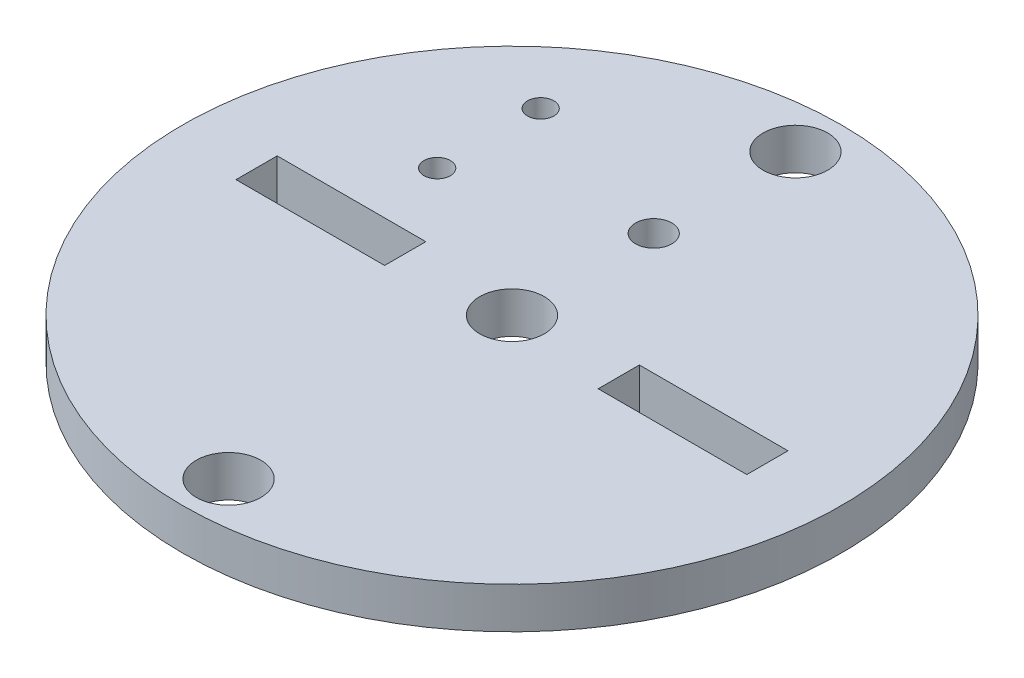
from build123d import *

# Parameters (mm, degrees)
SKETCH1_R              = 25.4
BOSS_EXTRUDE1_DEPTH    = 3.175
F_10_CLEARANCE_HOLE1_D = 4.9784
SKETCH5_W              = 11.4554
SKETCH5_H              = 3.175
CUT_EXTRUDE1_DEPTH     = 37.061067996
SKETCH6_R              = 1.397
SKETCH6_R_2            = 1.016
CUT_EXTRUDE2_DEPTH     = 37.061067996


with BuildPart() as part:
    # Sketch1 → Boss-Extrude1 (new body)
    with BuildSketch(Plane(origin=(0, 0, 0), x_dir=(1, 0, 0), z_dir=(0, 1, 0))):
        with Locations(Location((0, 0, 0), (0, 0, 270))):
            Circle(SKETCH1_R)
    extrude(amount=BOSS_EXTRUDE1_DEPTH)

    # 10 Clearance Hole1 (through all)
    with Locations(Plane(origin=(0, 3.175, 0), x_dir=(1, 0, 0), z_dir=(0, 1, 0))):
        with Locations((0, 0), (0, 21.844), (0, -21.844)):
            Hole(F_10_CLEARANCE_HOLE1_D / 2)

    # Sketch5 → Cut-Extrude1 (cut, through all)
    with BuildSketch(Plane(origin=(0, 3.175, 0), x_dir=(1, 0, 0), z_dir=(0, 1, 0))):
        with Locations((13.9573, 0)):
            Rectangle(SKETCH5_W, SKETCH5_H)
        with Locations((-13.9573, 0)):
            Rectangle(SKETCH5_W, SKETCH5_H)
    extrude(amount=-CUT_EXTRUDE1_DEPTH, mode=Mode.SUBTRACT)

    # Sketch6 → Cut-Extrude2 (cut, through all)
    with BuildSketch(Plane(origin=(0, 3.175, 0), x_dir=(1, 0, 0), z_dir=(0, 1, 0))):
        with Locations(Location((0, 10.922, 0), (0, 0, 270))):
            Circle(SKETCH6_R)
        with Locations(Location((-12.7, 14.9098, 0), (0, 0, 270))):
            Circle(SKETCH6_R_2)
        with Locations(Location((-12.7, 6.9342, 0), (0, 0, 90))):
            Circle(SKETCH6_R_2)
    extrude(amount=-CUT_EXTRUDE2_DEPTH, mode=Mode.SUBTRACT)


solid = part.part
